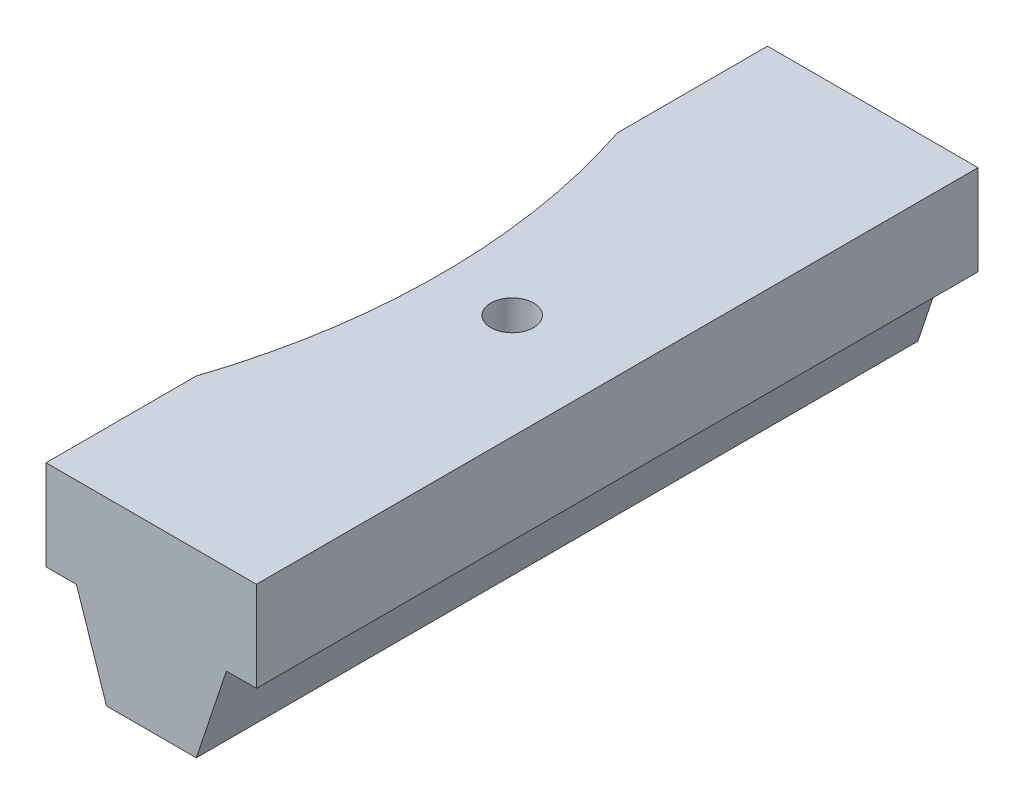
ISO-10303-21;
HEADER;
FILE_DESCRIPTION(('STEP AP214'),'2;1');
FILE_NAME('part.step','',(''),(''),'','','');
FILE_SCHEMA(('AUTOMOTIVE_DESIGN { 1 0 10303 214 1 1 1 1 }'));
ENDSEC;
DATA;
#1=APPLICATION_CONTEXT('core data for automotive mechanical design processes');
#2=APPLICATION_PROTOCOL_DEFINITION('international standard','automotive_design',2000,#1);
#3=PRODUCT_CONTEXT('',#1,'mechanical');
#4=PRODUCT('Part','Part','',(#3));
#5=PRODUCT_RELATED_PRODUCT_CATEGORY('part','',(#4));
#6=PRODUCT_DEFINITION_FORMATION('','',#4);
#7=PRODUCT_DEFINITION_CONTEXT('part definition',#1,'design');
#8=PRODUCT_DEFINITION('design','',#6,#7);
#9=PRODUCT_DEFINITION_SHAPE('','',#8);
#10=(LENGTH_UNIT() NAMED_UNIT(*) SI_UNIT(.MILLI.,.METRE.));
#11=(NAMED_UNIT(*) PLANE_ANGLE_UNIT() SI_UNIT($,.RADIAN.));
#12=(NAMED_UNIT(*) SI_UNIT($,.STERADIAN.) SOLID_ANGLE_UNIT());
#13=UNCERTAINTY_MEASURE_WITH_UNIT(LENGTH_MEASURE(1.E-05),#10,'distance_accuracy_value','');
#14=(GEOMETRIC_REPRESENTATION_CONTEXT(3) GLOBAL_UNCERTAINTY_ASSIGNED_CONTEXT((#13)) GLOBAL_UNIT_ASSIGNED_CONTEXT((#10,
#11,#12)) REPRESENTATION_CONTEXT('',''));
#15=CARTESIAN_POINT('',(0.,0.,0.));
#16=DIRECTION('',(0.,0.,1.));
#17=DIRECTION('',(1.,0.,0.));
#18=AXIS2_PLACEMENT_3D('',#15,#16,#17);
#19=CARTESIAN_POINT('',(-3.959225,-117.094,19.05));
#20=DIRECTION('',(0.,1.,0.));
#21=DIRECTION('',(0.,0.,1.));
#22=AXIS2_PLACEMENT_3D('',#19,#20,#21);
#23=PLANE('',#22);
#24=DIRECTION('',(0.,0.,-1.));
#25=VECTOR('',#24,1.);
#26=CARTESIAN_POINT('',(-5.565775,-117.094,19.05));
#27=LINE('',#26,#25);
#28=CARTESIAN_POINT('',(-5.565775,-117.094,19.05));
#29=VERTEX_POINT('',#28);
#30=CARTESIAN_POINT('',(-5.565775,-117.094,11.1211031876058));
#31=VERTEX_POINT('',#30);
#32=EDGE_CURVE('E166',#29,#31,#27,.T.);
#33=ORIENTED_EDGE('',*,*,#32,.T.);
#34=CARTESIAN_POINT('',(-39.1414,-117.094,0.));
#35=DIRECTION('',(0.,1.,0.));
#36=DIRECTION('',(0.,0.,1.));
#37=AXIS2_PLACEMENT_3D('',#34,#35,#36);
#38=CIRCLE('',#37,35.3695);
#39=CARTESIAN_POINT('',(-3.95922500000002,-117.094,3.6353944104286));
#40=VERTEX_POINT('',#39);
#41=EDGE_CURVE('E51',#31,#40,#38,.T.);
#42=ORIENTED_EDGE('',*,*,#41,.T.);
#43=DIRECTION('',(0.,0.,-1.));
#44=VECTOR('',#43,1.);
#45=CARTESIAN_POINT('',(-3.959225,-117.094,19.05));
#46=LINE('',#45,#44);
#47=CARTESIAN_POINT('',(-3.959225,-117.094,19.05));
#48=VERTEX_POINT('',#47);
#49=EDGE_CURVE('E182',#48,#40,#46,.T.);
#50=ORIENTED_EDGE('',*,*,#49,.F.);
#51=DIRECTION('',(1.,0.,0.));
#52=VECTOR('',#51,1.);
#53=CARTESIAN_POINT('',(-3.959225,-117.094,19.05));
#54=LINE('',#53,#52);
#55=EDGE_CURVE('E165',#29,#48,#54,.T.);
#56=ORIENTED_EDGE('',*,*,#55,.F.);
#57=EDGE_LOOP('',(#33,#42,#50,#56));
#58=FACE_BOUND('',#57,.T.);
#59=ADVANCED_FACE('F36',(#58),#23,.F.);
#60=CARTESIAN_POINT('',(-5.565775,-112.3315,19.05));
#61=DIRECTION('',(1.,0.,0.));
#62=DIRECTION('',(0.,1.,0.));
#63=AXIS2_PLACEMENT_3D('',#60,#61,#62);
#64=PLANE('',#63);
#65=CARTESIAN_POINT('',(-5.56577500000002,-117.094,-11.1211031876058));
#66=VERTEX_POINT('',#65);
#67=CARTESIAN_POINT('',(-5.565775,-117.094,-19.05));
#68=VERTEX_POINT('',#67);
#69=EDGE_CURVE('E94',#66,#68,#27,.T.);
#70=ORIENTED_EDGE('',*,*,#69,.F.);
#71=DIRECTION('',(0.,1.,0.));
#72=VECTOR('',#71,1.);
#73=CARTESIAN_POINT('',(-5.56577500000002,-121.8565,-11.1211031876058));
#74=LINE('',#73,#72);
#75=CARTESIAN_POINT('',(-5.56577500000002,-112.3315,-11.1211031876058));
#76=VERTEX_POINT('',#75);
#77=EDGE_CURVE('E11',#66,#76,#74,.T.);
#78=ORIENTED_EDGE('',*,*,#77,.T.);
#79=DIRECTION('',(0.,0.,-1.));
#80=VECTOR('',#79,1.);
#81=CARTESIAN_POINT('',(-5.565775,-112.3315,19.05));
#82=LINE('',#81,#80);
#83=CARTESIAN_POINT('',(-5.565775,-112.3315,-19.05));
#84=VERTEX_POINT('',#83);
#85=EDGE_CURVE('E169',#76,#84,#82,.T.);
#86=ORIENTED_EDGE('',*,*,#85,.T.);
#87=DIRECTION('',(0.,-1.,0.));
#88=VECTOR('',#87,1.);
#89=CARTESIAN_POINT('',(-5.565775,-112.3315,-19.05));
#90=LINE('',#89,#88);
#91=EDGE_CURVE('E163',#84,#68,#90,.T.);
#92=ORIENTED_EDGE('',*,*,#91,.T.);
#93=EDGE_LOOP('',(#70,#78,#86,#92));
#94=FACE_BOUND('',#93,.T.);
#95=ADVANCED_FACE('F217',(#94),#64,.F.);
#96=CARTESIAN_POINT('',(-3.959225,-117.094,-3.63539441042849));
#97=VERTEX_POINT('',#96);
#98=CARTESIAN_POINT('',(-3.959225,-117.094,-19.05));
#99=VERTEX_POINT('',#98);
#100=EDGE_CURVE('E181',#97,#99,#46,.T.);
#101=ORIENTED_EDGE('',*,*,#100,.F.);
#102=EDGE_CURVE('E222',#97,#66,#38,.T.);
#103=ORIENTED_EDGE('',*,*,#102,.T.);
#104=ORIENTED_EDGE('',*,*,#69,.T.);
#105=DIRECTION('',(1.,0.,0.));
#106=VECTOR('',#105,1.);
#107=CARTESIAN_POINT('',(-3.959225,-117.094,-19.05));
#108=LINE('',#107,#106);
#109=EDGE_CURVE('E149',#68,#99,#108,.T.);
#110=ORIENTED_EDGE('',*,*,#109,.T.);
#111=EDGE_LOOP('',(#101,#103,#104,#110));
#112=FACE_BOUND('',#111,.T.);
#113=ADVANCED_FACE('F38',(#112),#23,.F.);
#114=CARTESIAN_POINT('',(-2.371725,-121.8565,19.05));
#115=DIRECTION('',(0.948683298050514,0.316227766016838,0.));
#116=DIRECTION('',(-0.316227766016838,0.948683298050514,0.));
#117=AXIS2_PLACEMENT_3D('',#114,#115,#116);
#118=PLANE('',#117);
#119=ORIENTED_EDGE('',*,*,#49,.T.);
#120=CARTESIAN_POINT('',(-39.1414,-11.547475,0.));
#121=DIRECTION('',(0.948683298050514,0.316227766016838,0.));
#122=DIRECTION('',(-0.316227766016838,0.948683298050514,0.));
#123=AXIS2_PLACEMENT_3D('',#120,#121,#122);
#124=ELLIPSE('',#123,111.848179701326,35.3695);
#125=EDGE_CURVE('E226',#40,#97,#124,.T.);
#126=ORIENTED_EDGE('',*,*,#125,.T.);
#127=ORIENTED_EDGE('',*,*,#100,.T.);
#128=DIRECTION('',(0.316227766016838,-0.948683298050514,0.));
#129=VECTOR('',#128,1.);
#130=CARTESIAN_POINT('',(-2.371725,-121.8565,-19.05));
#131=LINE('',#130,#129);
#132=CARTESIAN_POINT('',(-2.371725,-121.8565,-19.05));
#133=VERTEX_POINT('',#132);
#134=EDGE_CURVE('E151',#99,#133,#131,.T.);
#135=ORIENTED_EDGE('',*,*,#134,.T.);
#136=DIRECTION('',(0.,0.,-1.));
#137=VECTOR('',#136,1.);
#138=CARTESIAN_POINT('',(-2.371725,-121.8565,19.05));
#139=LINE('',#138,#137);
#140=CARTESIAN_POINT('',(-2.371725,-121.8565,19.05));
#141=VERTEX_POINT('',#140);
#142=EDGE_CURVE('E178',#141,#133,#139,.T.);
#143=ORIENTED_EDGE('',*,*,#142,.F.);
#144=DIRECTION('',(0.316227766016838,-0.948683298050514,0.));
#145=VECTOR('',#144,1.);
#146=CARTESIAN_POINT('',(-2.371725,-121.8565,19.05));
#147=LINE('',#146,#145);
#148=EDGE_CURVE('E103',#48,#141,#147,.T.);
#149=ORIENTED_EDGE('',*,*,#148,.F.);
#150=EDGE_LOOP('',(#119,#126,#127,#135,#143,#149));
#151=FACE_BOUND('',#150,.T.);
#152=ADVANCED_FACE('F231',(#151),#118,.F.);
#153=CARTESIAN_POINT('',(2.371725,-121.8565,19.05));
#154=DIRECTION('',(0.,1.,0.));
#155=DIRECTION('',(0.,0.,1.));
#156=AXIS2_PLACEMENT_3D('',#153,#154,#155);
#157=PLANE('',#156);
#158=CARTESIAN_POINT('',(0.,-121.8565,0.));
#159=DIRECTION('',(0.,1.,0.));
#160=DIRECTION('',(0.,0.,1.));
#161=AXIS2_PLACEMENT_3D('',#158,#159,#160);
#162=CIRCLE('',#161,1.1303);
#163=CARTESIAN_POINT('',(0.,-121.8565,1.1303));
#164=VERTEX_POINT('',#163);
#165=EDGE_CURVE('E152',#164,#164,#162,.T.);
#166=ORIENTED_EDGE('',*,*,#165,.T.);
#167=EDGE_LOOP('',(#166));
#168=FACE_BOUND('',#167,.T.);
#169=DIRECTION('',(1.,0.,0.));
#170=VECTOR('',#169,1.);
#171=CARTESIAN_POINT('',(2.371725,-121.8565,-19.05));
#172=LINE('',#171,#170);
#173=CARTESIAN_POINT('',(2.371725,-121.8565,-19.05));
#174=VERTEX_POINT('',#173);
#175=EDGE_CURVE('E154',#133,#174,#172,.T.);
#176=ORIENTED_EDGE('',*,*,#175,.T.);
#177=DIRECTION('',(0.,0.,-1.));
#178=VECTOR('',#177,1.);
#179=CARTESIAN_POINT('',(2.371725,-121.8565,19.05));
#180=LINE('',#179,#178);
#181=CARTESIAN_POINT('',(2.371725,-121.8565,19.05));
#182=VERTEX_POINT('',#181);
#183=EDGE_CURVE('E175',#182,#174,#180,.T.);
#184=ORIENTED_EDGE('',*,*,#183,.F.);
#185=DIRECTION('',(1.,0.,0.));
#186=VECTOR('',#185,1.);
#187=CARTESIAN_POINT('',(2.371725,-121.8565,19.05));
#188=LINE('',#187,#186);
#189=EDGE_CURVE('E192',#141,#182,#188,.T.);
#190=ORIENTED_EDGE('',*,*,#189,.F.);
#191=ORIENTED_EDGE('',*,*,#142,.T.);
#192=EDGE_LOOP('',(#176,#184,#190,#191));
#193=FACE_BOUND('',#192,.T.);
#194=ADVANCED_FACE('F237',(#168,#193),#157,.F.);
#195=CARTESIAN_POINT('',(3.959225,-117.094,19.05));
#196=DIRECTION('',(-0.948683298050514,0.316227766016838,0.));
#197=DIRECTION('',(-0.316227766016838,-0.948683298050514,0.));
#198=AXIS2_PLACEMENT_3D('',#195,#196,#197);
#199=PLANE('',#198);
#200=DIRECTION('',(0.316227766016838,0.948683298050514,0.));
#201=VECTOR('',#200,1.);
#202=CARTESIAN_POINT('',(3.959225,-117.094,-19.05));
#203=LINE('',#202,#201);
#204=CARTESIAN_POINT('',(3.959225,-117.094,-19.05));
#205=VERTEX_POINT('',#204);
#206=EDGE_CURVE('E156',#174,#205,#203,.T.);
#207=ORIENTED_EDGE('',*,*,#206,.T.);
#208=DIRECTION('',(0.,0.,-1.));
#209=VECTOR('',#208,1.);
#210=CARTESIAN_POINT('',(3.959225,-117.094,19.05));
#211=LINE('',#210,#209);
#212=CARTESIAN_POINT('',(3.959225,-117.094,19.05));
#213=VERTEX_POINT('',#212);
#214=EDGE_CURVE('E172',#213,#205,#211,.T.);
#215=ORIENTED_EDGE('',*,*,#214,.F.);
#216=DIRECTION('',(0.316227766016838,0.948683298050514,0.));
#217=VECTOR('',#216,1.);
#218=CARTESIAN_POINT('',(3.959225,-117.094,19.05));
#219=LINE('',#218,#217);
#220=EDGE_CURVE('E198',#182,#213,#219,.T.);
#221=ORIENTED_EDGE('',*,*,#220,.F.);
#222=ORIENTED_EDGE('',*,*,#183,.T.);
#223=EDGE_LOOP('',(#207,#215,#221,#222));
#224=FACE_BOUND('',#223,.T.);
#225=ADVANCED_FACE('F204',(#224),#199,.F.);
#226=CARTESIAN_POINT('',(3.959225,-117.094,19.05));
#227=DIRECTION('',(0.,1.,0.));
#228=DIRECTION('',(0.,0.,1.));
#229=AXIS2_PLACEMENT_3D('',#226,#227,#228);
#230=PLANE('',#229);
#231=DIRECTION('',(1.,0.,0.));
#232=VECTOR('',#231,1.);
#233=CARTESIAN_POINT('',(3.959225,-117.094,-19.05));
#234=LINE('',#233,#232);
#235=CARTESIAN_POINT('',(5.546725,-117.094,-19.05));
#236=VERTEX_POINT('',#235);
#237=EDGE_CURVE('E158',#205,#236,#234,.T.);
#238=ORIENTED_EDGE('',*,*,#237,.T.);
#239=DIRECTION('',(0.,0.,-1.));
#240=VECTOR('',#239,1.);
#241=CARTESIAN_POINT('',(5.546725,-117.094,19.05));
#242=LINE('',#241,#240);
#243=CARTESIAN_POINT('',(5.546725,-117.094,19.05));
#244=VERTEX_POINT('',#243);
#245=EDGE_CURVE('E138',#244,#236,#242,.T.);
#246=ORIENTED_EDGE('',*,*,#245,.F.);
#247=DIRECTION('',(1.,0.,0.));
#248=VECTOR('',#247,1.);
#249=CARTESIAN_POINT('',(3.959225,-117.094,19.05));
#250=LINE('',#249,#248);
#251=EDGE_CURVE('E125',#213,#244,#250,.T.);
#252=ORIENTED_EDGE('',*,*,#251,.F.);
#253=ORIENTED_EDGE('',*,*,#214,.T.);
#254=EDGE_LOOP('',(#238,#246,#252,#253));
#255=FACE_BOUND('',#254,.T.);
#256=ADVANCED_FACE('F208',(#255),#230,.F.);
#257=CARTESIAN_POINT('',(5.546725,-112.3315,19.05));
#258=DIRECTION('',(-1.,0.,0.));
#259=DIRECTION('',(0.,-1.,0.));
#260=AXIS2_PLACEMENT_3D('',#257,#258,#259);
#261=PLANE('',#260);
#262=DIRECTION('',(0.,1.,0.));
#263=VECTOR('',#262,1.);
#264=CARTESIAN_POINT('',(5.546725,-112.3315,-19.05));
#265=LINE('',#264,#263);
#266=CARTESIAN_POINT('',(5.546725,-112.3315,-19.05));
#267=VERTEX_POINT('',#266);
#268=EDGE_CURVE('E134',#236,#267,#265,.T.);
#269=ORIENTED_EDGE('',*,*,#268,.T.);
#270=DIRECTION('',(0.,0.,-1.));
#271=VECTOR('',#270,1.);
#272=CARTESIAN_POINT('',(5.546725,-112.3315,19.05));
#273=LINE('',#272,#271);
#274=CARTESIAN_POINT('',(5.546725,-112.3315,19.05));
#275=VERTEX_POINT('',#274);
#276=EDGE_CURVE('E131',#275,#267,#273,.T.);
#277=ORIENTED_EDGE('',*,*,#276,.F.);
#278=DIRECTION('',(0.,1.,0.));
#279=VECTOR('',#278,1.);
#280=CARTESIAN_POINT('',(5.546725,-112.3315,19.05));
#281=LINE('',#280,#279);
#282=EDGE_CURVE('E118',#244,#275,#281,.T.);
#283=ORIENTED_EDGE('',*,*,#282,.F.);
#284=ORIENTED_EDGE('',*,*,#245,.T.);
#285=EDGE_LOOP('',(#269,#277,#283,#284));
#286=FACE_BOUND('',#285,.T.);
#287=ADVANCED_FACE('F132',(#286),#261,.F.);
#288=CARTESIAN_POINT('',(-5.565775,-112.3315,19.05));
#289=DIRECTION('',(0.,-1.,0.));
#290=DIRECTION('',(0.,0.,-1.));
#291=AXIS2_PLACEMENT_3D('',#288,#289,#290);
#292=PLANE('',#291);
#293=CARTESIAN_POINT('',(0.,-112.3315,0.));
#294=DIRECTION('',(0.,1.,0.));
#295=DIRECTION('',(0.,0.,1.));
#296=AXIS2_PLACEMENT_3D('',#293,#294,#295);
#297=CIRCLE('',#296,1.13029999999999);
#298=CARTESIAN_POINT('',(0.,-112.3315,1.13029999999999));
#299=VERTEX_POINT('',#298);
#300=EDGE_CURVE('E225',#299,#299,#297,.T.);
#301=ORIENTED_EDGE('',*,*,#300,.F.);
#302=EDGE_LOOP('',(#301));
#303=FACE_BOUND('',#302,.T.);
#304=ORIENTED_EDGE('',*,*,#85,.F.);
#305=CARTESIAN_POINT('',(-39.1414,-112.3315,0.));
#306=DIRECTION('',(0.,-1.,0.));
#307=DIRECTION('',(0.,0.,-1.));
#308=AXIS2_PLACEMENT_3D('',#305,#306,#307);
#309=CIRCLE('',#308,35.3695);
#310=CARTESIAN_POINT('',(-5.56577500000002,-112.3315,11.1211031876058));
#311=VERTEX_POINT('',#310);
#312=EDGE_CURVE('E214',#76,#311,#309,.T.);
#313=ORIENTED_EDGE('',*,*,#312,.T.);
#314=CARTESIAN_POINT('',(-5.565775,-112.3315,19.05));
#315=VERTEX_POINT('',#314);
#316=EDGE_CURVE('E139',#315,#311,#82,.T.);
#317=ORIENTED_EDGE('',*,*,#316,.F.);
#318=DIRECTION('',(-1.,0.,0.));
#319=VECTOR('',#318,1.);
#320=CARTESIAN_POINT('',(-5.565775,-112.3315,19.05));
#321=LINE('',#320,#319);
#322=EDGE_CURVE('E122',#275,#315,#321,.T.);
#323=ORIENTED_EDGE('',*,*,#322,.F.);
#324=ORIENTED_EDGE('',*,*,#276,.T.);
#325=DIRECTION('',(-1.,0.,0.));
#326=VECTOR('',#325,1.);
#327=CARTESIAN_POINT('',(-5.565775,-112.3315,-19.05));
#328=LINE('',#327,#326);
#329=EDGE_CURVE('E161',#267,#84,#328,.T.);
#330=ORIENTED_EDGE('',*,*,#329,.T.);
#331=EDGE_LOOP('',(#304,#313,#317,#323,#324,#330));
#332=FACE_BOUND('',#331,.T.);
#333=ADVANCED_FACE('F142',(#303,#332),#292,.F.);
#334=ORIENTED_EDGE('',*,*,#316,.T.);
#335=DIRECTION('',(0.,1.,0.));
#336=VECTOR('',#335,1.);
#337=CARTESIAN_POINT('',(-5.56577500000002,-121.8565,11.1211031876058));
#338=LINE('',#337,#336);
#339=EDGE_CURVE('E44',#311,#31,#338,.F.);
#340=ORIENTED_EDGE('',*,*,#339,.T.);
#341=ORIENTED_EDGE('',*,*,#32,.F.);
#342=DIRECTION('',(0.,-1.,0.));
#343=VECTOR('',#342,1.);
#344=CARTESIAN_POINT('',(-5.565775,-112.3315,19.05));
#345=LINE('',#344,#343);
#346=EDGE_CURVE('E60',#315,#29,#345,.T.);
#347=ORIENTED_EDGE('',*,*,#346,.F.);
#348=EDGE_LOOP('',(#334,#340,#341,#347));
#349=FACE_BOUND('',#348,.T.);
#350=ADVANCED_FACE('F184',(#349),#64,.F.);
#351=CARTESIAN_POINT('',(-5.565775,-117.094,19.05));
#352=DIRECTION('',(0.,0.,1.));
#353=DIRECTION('',(1.,0.,0.));
#354=AXIS2_PLACEMENT_3D('',#351,#352,#353);
#355=PLANE('',#354);
#356=ORIENTED_EDGE('',*,*,#55,.T.);
#357=ORIENTED_EDGE('',*,*,#148,.T.);
#358=ORIENTED_EDGE('',*,*,#189,.T.);
#359=ORIENTED_EDGE('',*,*,#220,.T.);
#360=ORIENTED_EDGE('',*,*,#251,.T.);
#361=ORIENTED_EDGE('',*,*,#282,.T.);
#362=ORIENTED_EDGE('',*,*,#322,.T.);
#363=ORIENTED_EDGE('',*,*,#346,.T.);
#364=EDGE_LOOP('',(#356,#357,#358,#359,#360,#361,#362,#363));
#365=FACE_BOUND('',#364,.T.);
#366=ADVANCED_FACE('F120',(#365),#355,.T.);
#367=CARTESIAN_POINT('',(-5.565775,-117.094,-19.05));
#368=DIRECTION('',(0.,0.,1.));
#369=DIRECTION('',(1.,0.,0.));
#370=AXIS2_PLACEMENT_3D('',#367,#368,#369);
#371=PLANE('',#370);
#372=ORIENTED_EDGE('',*,*,#109,.F.);
#373=ORIENTED_EDGE('',*,*,#91,.F.);
#374=ORIENTED_EDGE('',*,*,#329,.F.);
#375=ORIENTED_EDGE('',*,*,#268,.F.);
#376=ORIENTED_EDGE('',*,*,#237,.F.);
#377=ORIENTED_EDGE('',*,*,#206,.F.);
#378=ORIENTED_EDGE('',*,*,#175,.F.);
#379=ORIENTED_EDGE('',*,*,#134,.F.);
#380=EDGE_LOOP('',(#372,#373,#374,#375,#376,#377,#378,#379));
#381=FACE_BOUND('',#380,.T.);
#382=ADVANCED_FACE('F211',(#381),#371,.F.);
#383=CARTESIAN_POINT('',(0.,-112.3315,0.));
#384=DIRECTION('',(0.,1.,0.));
#385=DIRECTION('',(0.,0.,1.));
#386=AXIS2_PLACEMENT_3D('',#383,#384,#385);
#387=CYLINDRICAL_SURFACE('',#386,1.13029999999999);
#388=ORIENTED_EDGE('',*,*,#165,.F.);
#389=EDGE_LOOP('',(#388));
#390=FACE_BOUND('',#389,.T.);
#391=ORIENTED_EDGE('',*,*,#300,.T.);
#392=EDGE_LOOP('',(#391));
#393=FACE_BOUND('',#392,.T.);
#394=ADVANCED_FACE('F290',(#390,#393),#387,.F.);
#395=CARTESIAN_POINT('',(-39.1414,-121.8565,0.));
#396=DIRECTION('',(0.,1.,0.));
#397=DIRECTION('',(0.,0.,1.));
#398=AXIS2_PLACEMENT_3D('',#395,#396,#397);
#399=CYLINDRICAL_SURFACE('',#398,35.3695);
#400=ORIENTED_EDGE('',*,*,#125,.F.);
#401=ORIENTED_EDGE('',*,*,#41,.F.);
#402=ORIENTED_EDGE('',*,*,#339,.F.);
#403=ORIENTED_EDGE('',*,*,#312,.F.);
#404=ORIENTED_EDGE('',*,*,#77,.F.);
#405=ORIENTED_EDGE('',*,*,#102,.F.);
#406=EDGE_LOOP('',(#400,#401,#402,#403,#404,#405));
#407=FACE_BOUND('',#406,.T.);
#408=ADVANCED_FACE('F221',(#407),#399,.F.);
#409=CLOSED_SHELL('',(#59,#95,#113,#152,#194,#225,#256,#287,#333,#350,#366,#382,#394,#408));
#410=MANIFOLD_SOLID_BREP('B2',#409);
#411=ADVANCED_BREP_SHAPE_REPRESENTATION('',(#18,#410),#14);
#412=SHAPE_DEFINITION_REPRESENTATION(#9,#411);
ENDSEC;
END-ISO-10303-21;
